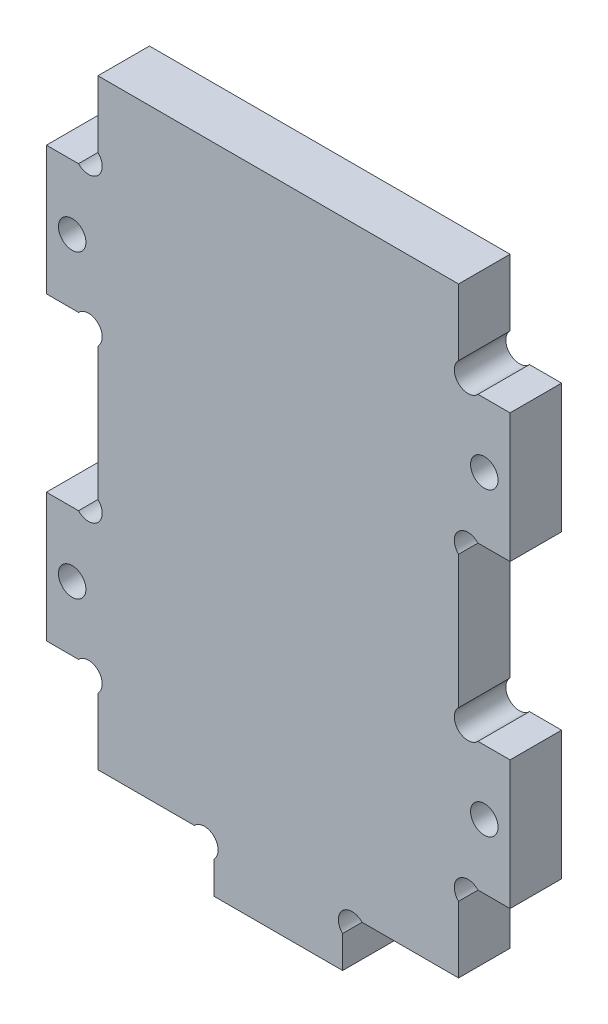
ISO-10303-21;
HEADER;
FILE_DESCRIPTION(('STEP AP214'),'2;1');
FILE_NAME('part.step','',(''),(''),'','','');
FILE_SCHEMA(('AUTOMOTIVE_DESIGN { 1 0 10303 214 1 1 1 1 }'));
ENDSEC;
DATA;
#1=APPLICATION_CONTEXT('core data for automotive mechanical design processes');
#2=APPLICATION_PROTOCOL_DEFINITION('international standard','automotive_design',2000,#1);
#3=PRODUCT_CONTEXT('',#1,'mechanical');
#4=PRODUCT('Part','Part','',(#3));
#5=PRODUCT_RELATED_PRODUCT_CATEGORY('part','',(#4));
#6=PRODUCT_DEFINITION_FORMATION('','',#4);
#7=PRODUCT_DEFINITION_CONTEXT('part definition',#1,'design');
#8=PRODUCT_DEFINITION('design','',#6,#7);
#9=PRODUCT_DEFINITION_SHAPE('','',#8);
#10=(LENGTH_UNIT() NAMED_UNIT(*) SI_UNIT(.MILLI.,.METRE.));
#11=(NAMED_UNIT(*) PLANE_ANGLE_UNIT() SI_UNIT($,.RADIAN.));
#12=(NAMED_UNIT(*) SI_UNIT($,.STERADIAN.) SOLID_ANGLE_UNIT());
#13=UNCERTAINTY_MEASURE_WITH_UNIT(LENGTH_MEASURE(1.E-05),#10,'distance_accuracy_value','');
#14=(GEOMETRIC_REPRESENTATION_CONTEXT(3) GLOBAL_UNCERTAINTY_ASSIGNED_CONTEXT((#13)) GLOBAL_UNIT_ASSIGNED_CONTEXT((#10,
#11,#12)) REPRESENTATION_CONTEXT('',''));
#15=CARTESIAN_POINT('',(0.,0.,0.));
#16=DIRECTION('',(0.,0.,1.));
#17=DIRECTION('',(1.,0.,0.));
#18=AXIS2_PLACEMENT_3D('',#15,#16,#17);
#19=CARTESIAN_POINT('',(22.1,61.1,6.));
#20=DIRECTION('',(0.,0.,1.));
#21=DIRECTION('',(1.,0.,0.));
#22=AXIS2_PLACEMENT_3D('',#19,#20,#21);
#23=PLANE('',#22);
#24=CARTESIAN_POINT('',(-24.,52.5,6.));
#25=DIRECTION('',(0.,0.,1.));
#26=DIRECTION('',(-1.,0.,0.));
#27=AXIS2_PLACEMENT_3D('',#24,#25,#26);
#28=CIRCLE('',#27,1.6);
#29=CARTESIAN_POINT('',(-25.6,52.5,6.));
#30=VERTEX_POINT('',#29);
#31=EDGE_CURVE('E705',#30,#30,#28,.T.);
#32=ORIENTED_EDGE('',*,*,#31,.F.);
#33=EDGE_LOOP('',(#32));
#34=FACE_BOUND('',#33,.T.);
#35=CARTESIAN_POINT('',(24.,52.5,6.));
#36=DIRECTION('',(0.,0.,1.));
#37=DIRECTION('',(1.,0.,0.));
#38=AXIS2_PLACEMENT_3D('',#35,#36,#37);
#39=CIRCLE('',#38,1.6);
#40=CARTESIAN_POINT('',(25.6,52.5,6.));
#41=VERTEX_POINT('',#40);
#42=EDGE_CURVE('E275',#41,#41,#39,.T.);
#43=ORIENTED_EDGE('',*,*,#42,.F.);
#44=EDGE_LOOP('',(#43));
#45=FACE_BOUND('',#44,.T.);
#46=DIRECTION('',(0.,1.,0.));
#47=VECTOR('',#46,1.);
#48=CARTESIAN_POINT('',(21.,70.,6.));
#49=LINE('',#48,#47);
#50=CARTESIAN_POINT('',(21.,62.2618950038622,6.));
#51=VERTEX_POINT('',#50);
#52=CARTESIAN_POINT('',(21.,70.,6.));
#53=VERTEX_POINT('',#52);
#54=EDGE_CURVE('E345',#51,#53,#49,.T.);
#55=ORIENTED_EDGE('',*,*,#54,.T.);
#56=DIRECTION('',(-1.,0.,0.));
#57=VECTOR('',#56,1.);
#58=CARTESIAN_POINT('',(-21.,70.,6.));
#59=LINE('',#58,#57);
#60=CARTESIAN_POINT('',(-21.,70.,6.));
#61=VERTEX_POINT('',#60);
#62=EDGE_CURVE('E270',#53,#61,#59,.T.);
#63=ORIENTED_EDGE('',*,*,#62,.T.);
#64=DIRECTION('',(0.,-1.,0.));
#65=VECTOR('',#64,1.);
#66=CARTESIAN_POINT('',(-21.,70.,6.));
#67=LINE('',#66,#65);
#68=CARTESIAN_POINT('',(-21.,62.2618950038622,6.));
#69=VERTEX_POINT('',#68);
#70=EDGE_CURVE('E348',#61,#69,#67,.T.);
#71=ORIENTED_EDGE('',*,*,#70,.T.);
#72=CARTESIAN_POINT('',(-22.1,61.1,6.));
#73=DIRECTION('',(0.,0.,-1.));
#74=DIRECTION('',(-1.,0.,0.));
#75=AXIS2_PLACEMENT_3D('',#72,#73,#74);
#76=CIRCLE('',#75,1.6);
#77=CARTESIAN_POINT('',(-23.2618950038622,60.,6.));
#78=VERTEX_POINT('',#77);
#79=EDGE_CURVE('E350',#69,#78,#76,.T.);
#80=ORIENTED_EDGE('',*,*,#79,.T.);
#81=DIRECTION('',(-1.,0.,0.));
#82=VECTOR('',#81,1.);
#83=CARTESIAN_POINT('',(-23.2618950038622,60.,6.));
#84=LINE('',#83,#82);
#85=CARTESIAN_POINT('',(-27.,60.,6.));
#86=VERTEX_POINT('',#85);
#87=EDGE_CURVE('E352',#78,#86,#84,.T.);
#88=ORIENTED_EDGE('',*,*,#87,.T.);
#89=DIRECTION('',(0.,-1.,0.));
#90=VECTOR('',#89,1.);
#91=CARTESIAN_POINT('',(-27.,60.,6.));
#92=LINE('',#91,#90);
#93=CARTESIAN_POINT('',(-27.,45.,6.));
#94=VERTEX_POINT('',#93);
#95=EDGE_CURVE('E354',#86,#94,#92,.T.);
#96=ORIENTED_EDGE('',*,*,#95,.T.);
#97=DIRECTION('',(1.,0.,0.));
#98=VECTOR('',#97,1.);
#99=CARTESIAN_POINT('',(-27.,45.,6.));
#100=LINE('',#99,#98);
#101=CARTESIAN_POINT('',(-23.2618950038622,45.,6.));
#102=VERTEX_POINT('',#101);
#103=EDGE_CURVE('E356',#94,#102,#100,.T.);
#104=ORIENTED_EDGE('',*,*,#103,.T.);
#105=CARTESIAN_POINT('',(-22.1,43.9,6.));
#106=DIRECTION('',(0.,0.,-1.));
#107=DIRECTION('',(-1.,0.,0.));
#108=AXIS2_PLACEMENT_3D('',#105,#106,#107);
#109=CIRCLE('',#108,1.6);
#110=CARTESIAN_POINT('',(-21.,42.7381049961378,6.));
#111=VERTEX_POINT('',#110);
#112=EDGE_CURVE('E358',#102,#111,#109,.T.);
#113=ORIENTED_EDGE('',*,*,#112,.T.);
#114=DIRECTION('',(0.,-1.,0.));
#115=VECTOR('',#114,1.);
#116=CARTESIAN_POINT('',(-21.,42.7381049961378,6.));
#117=LINE('',#116,#115);
#118=CARTESIAN_POINT('',(-21.,27.2618950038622,6.));
#119=VERTEX_POINT('',#118);
#120=EDGE_CURVE('E360',#111,#119,#117,.T.);
#121=ORIENTED_EDGE('',*,*,#120,.T.);
#122=CARTESIAN_POINT('',(-22.1,26.1,6.));
#123=DIRECTION('',(0.,0.,-1.));
#124=DIRECTION('',(-1.,0.,0.));
#125=AXIS2_PLACEMENT_3D('',#122,#123,#124);
#126=CIRCLE('',#125,1.6);
#127=CARTESIAN_POINT('',(-23.2618950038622,25.,6.));
#128=VERTEX_POINT('',#127);
#129=EDGE_CURVE('E362',#119,#128,#126,.T.);
#130=ORIENTED_EDGE('',*,*,#129,.T.);
#131=DIRECTION('',(-1.,0.,0.));
#132=VECTOR('',#131,1.);
#133=CARTESIAN_POINT('',(-23.2618950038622,25.,6.));
#134=LINE('',#133,#132);
#135=CARTESIAN_POINT('',(-27.,25.,6.));
#136=VERTEX_POINT('',#135);
#137=EDGE_CURVE('E364',#128,#136,#134,.T.);
#138=ORIENTED_EDGE('',*,*,#137,.T.);
#139=DIRECTION('',(0.,-1.,0.));
#140=VECTOR('',#139,1.);
#141=CARTESIAN_POINT('',(-27.,25.,6.));
#142=LINE('',#141,#140);
#143=CARTESIAN_POINT('',(-27.,10.,6.));
#144=VERTEX_POINT('',#143);
#145=EDGE_CURVE('E366',#136,#144,#142,.T.);
#146=ORIENTED_EDGE('',*,*,#145,.T.);
#147=DIRECTION('',(1.,0.,0.));
#148=VECTOR('',#147,1.);
#149=CARTESIAN_POINT('',(-27.,10.,6.));
#150=LINE('',#149,#148);
#151=CARTESIAN_POINT('',(-23.2618950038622,10.,6.));
#152=VERTEX_POINT('',#151);
#153=EDGE_CURVE('E368',#144,#152,#150,.T.);
#154=ORIENTED_EDGE('',*,*,#153,.T.);
#155=CARTESIAN_POINT('',(-22.1,8.9,6.));
#156=DIRECTION('',(0.,0.,-1.));
#157=DIRECTION('',(-1.,0.,0.));
#158=AXIS2_PLACEMENT_3D('',#155,#156,#157);
#159=CIRCLE('',#158,1.6);
#160=CARTESIAN_POINT('',(-21.,7.73810499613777,6.));
#161=VERTEX_POINT('',#160);
#162=EDGE_CURVE('E370',#152,#161,#159,.T.);
#163=ORIENTED_EDGE('',*,*,#162,.T.);
#164=DIRECTION('',(0.,-1.,0.));
#165=VECTOR('',#164,1.);
#166=CARTESIAN_POINT('',(-21.,7.73810499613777,6.));
#167=LINE('',#166,#165);
#168=CARTESIAN_POINT('',(-21.,0.,6.));
#169=VERTEX_POINT('',#168);
#170=EDGE_CURVE('E372',#161,#169,#167,.T.);
#171=ORIENTED_EDGE('',*,*,#170,.T.);
#172=DIRECTION('',(1.,0.,0.));
#173=VECTOR('',#172,1.);
#174=CARTESIAN_POINT('',(-9.76189500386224,0.,6.));
#175=LINE('',#174,#173);
#176=CARTESIAN_POINT('',(-9.76189500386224,0.,6.));
#177=VERTEX_POINT('',#176);
#178=EDGE_CURVE('E374',#169,#177,#175,.T.);
#179=ORIENTED_EDGE('',*,*,#178,.T.);
#180=CARTESIAN_POINT('',(-8.60000000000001,-1.1,6.));
#181=DIRECTION('',(0.,0.,-1.));
#182=DIRECTION('',(-1.,0.,0.));
#183=AXIS2_PLACEMENT_3D('',#180,#181,#182);
#184=CIRCLE('',#183,1.6);
#185=CARTESIAN_POINT('',(-7.50000000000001,-2.26189500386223,6.));
#186=VERTEX_POINT('',#185);
#187=EDGE_CURVE('E376',#177,#186,#184,.T.);
#188=ORIENTED_EDGE('',*,*,#187,.T.);
#189=DIRECTION('',(0.,-1.,0.));
#190=VECTOR('',#189,1.);
#191=CARTESIAN_POINT('',(-7.50000000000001,-2.26189500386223,6.));
#192=LINE('',#191,#190);
#193=CARTESIAN_POINT('',(-7.50000000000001,-6.,6.));
#194=VERTEX_POINT('',#193);
#195=EDGE_CURVE('E378',#186,#194,#192,.T.);
#196=ORIENTED_EDGE('',*,*,#195,.T.);
#197=DIRECTION('',(1.,0.,0.));
#198=VECTOR('',#197,1.);
#199=CARTESIAN_POINT('',(7.50000000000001,-6.,6.));
#200=LINE('',#199,#198);
#201=CARTESIAN_POINT('',(7.50000000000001,-6.,6.));
#202=VERTEX_POINT('',#201);
#203=EDGE_CURVE('E380',#194,#202,#200,.T.);
#204=ORIENTED_EDGE('',*,*,#203,.T.);
#205=DIRECTION('',(0.,1.,0.));
#206=VECTOR('',#205,1.);
#207=CARTESIAN_POINT('',(7.50000000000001,-2.26189500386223,6.));
#208=LINE('',#207,#206);
#209=CARTESIAN_POINT('',(7.50000000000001,-2.26189500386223,6.));
#210=VERTEX_POINT('',#209);
#211=EDGE_CURVE('E382',#202,#210,#208,.T.);
#212=ORIENTED_EDGE('',*,*,#211,.T.);
#213=CARTESIAN_POINT('',(8.60000000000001,-1.1,6.));
#214=DIRECTION('',(0.,0.,-1.));
#215=DIRECTION('',(1.,0.,0.));
#216=AXIS2_PLACEMENT_3D('',#213,#214,#215);
#217=CIRCLE('',#216,1.6);
#218=CARTESIAN_POINT('',(9.76189500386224,0.,6.));
#219=VERTEX_POINT('',#218);
#220=EDGE_CURVE('E384',#210,#219,#217,.T.);
#221=ORIENTED_EDGE('',*,*,#220,.T.);
#222=DIRECTION('',(1.,0.,0.));
#223=VECTOR('',#222,1.);
#224=CARTESIAN_POINT('',(9.76189500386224,0.,6.));
#225=LINE('',#224,#223);
#226=CARTESIAN_POINT('',(21.,0.,6.));
#227=VERTEX_POINT('',#226);
#228=EDGE_CURVE('E386',#219,#227,#225,.T.);
#229=ORIENTED_EDGE('',*,*,#228,.T.);
#230=DIRECTION('',(0.,1.,0.));
#231=VECTOR('',#230,1.);
#232=CARTESIAN_POINT('',(21.,7.73810499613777,6.));
#233=LINE('',#232,#231);
#234=CARTESIAN_POINT('',(21.,7.73810499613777,6.));
#235=VERTEX_POINT('',#234);
#236=EDGE_CURVE('E388',#227,#235,#233,.T.);
#237=ORIENTED_EDGE('',*,*,#236,.T.);
#238=CARTESIAN_POINT('',(22.1,8.9,6.));
#239=DIRECTION('',(0.,0.,-1.));
#240=DIRECTION('',(1.,0.,0.));
#241=AXIS2_PLACEMENT_3D('',#238,#239,#240);
#242=CIRCLE('',#241,1.6);
#243=CARTESIAN_POINT('',(23.2618950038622,10.,6.));
#244=VERTEX_POINT('',#243);
#245=EDGE_CURVE('E390',#235,#244,#242,.T.);
#246=ORIENTED_EDGE('',*,*,#245,.T.);
#247=DIRECTION('',(1.,0.,0.));
#248=VECTOR('',#247,1.);
#249=CARTESIAN_POINT('',(27.,10.,6.));
#250=LINE('',#249,#248);
#251=CARTESIAN_POINT('',(27.,10.,6.));
#252=VERTEX_POINT('',#251);
#253=EDGE_CURVE('E392',#244,#252,#250,.T.);
#254=ORIENTED_EDGE('',*,*,#253,.T.);
#255=DIRECTION('',(0.,1.,0.));
#256=VECTOR('',#255,1.);
#257=CARTESIAN_POINT('',(27.,25.,6.));
#258=LINE('',#257,#256);
#259=CARTESIAN_POINT('',(27.,25.,6.));
#260=VERTEX_POINT('',#259);
#261=EDGE_CURVE('E394',#252,#260,#258,.T.);
#262=ORIENTED_EDGE('',*,*,#261,.T.);
#263=DIRECTION('',(-1.,0.,0.));
#264=VECTOR('',#263,1.);
#265=CARTESIAN_POINT('',(23.2618950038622,25.,6.));
#266=LINE('',#265,#264);
#267=CARTESIAN_POINT('',(23.2618950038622,25.,6.));
#268=VERTEX_POINT('',#267);
#269=EDGE_CURVE('E396',#260,#268,#266,.T.);
#270=ORIENTED_EDGE('',*,*,#269,.T.);
#271=CARTESIAN_POINT('',(22.1,26.1,6.));
#272=DIRECTION('',(0.,0.,-1.));
#273=DIRECTION('',(1.,0.,0.));
#274=AXIS2_PLACEMENT_3D('',#271,#272,#273);
#275=CIRCLE('',#274,1.6);
#276=CARTESIAN_POINT('',(21.,27.2618950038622,6.));
#277=VERTEX_POINT('',#276);
#278=EDGE_CURVE('E398',#268,#277,#275,.T.);
#279=ORIENTED_EDGE('',*,*,#278,.T.);
#280=DIRECTION('',(0.,1.,0.));
#281=VECTOR('',#280,1.);
#282=CARTESIAN_POINT('',(21.,42.7381049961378,6.));
#283=LINE('',#282,#281);
#284=CARTESIAN_POINT('',(21.,42.7381049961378,6.));
#285=VERTEX_POINT('',#284);
#286=EDGE_CURVE('E400',#277,#285,#283,.T.);
#287=ORIENTED_EDGE('',*,*,#286,.T.);
#288=CARTESIAN_POINT('',(22.1,43.9,6.));
#289=DIRECTION('',(0.,0.,-1.));
#290=DIRECTION('',(1.,0.,0.));
#291=AXIS2_PLACEMENT_3D('',#288,#289,#290);
#292=CIRCLE('',#291,1.6);
#293=CARTESIAN_POINT('',(23.2618950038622,45.,6.));
#294=VERTEX_POINT('',#293);
#295=EDGE_CURVE('E402',#285,#294,#292,.T.);
#296=ORIENTED_EDGE('',*,*,#295,.T.);
#297=DIRECTION('',(1.,0.,0.));
#298=VECTOR('',#297,1.);
#299=CARTESIAN_POINT('',(27.,45.,6.));
#300=LINE('',#299,#298);
#301=CARTESIAN_POINT('',(27.,45.,6.));
#302=VERTEX_POINT('',#301);
#303=EDGE_CURVE('E404',#294,#302,#300,.T.);
#304=ORIENTED_EDGE('',*,*,#303,.T.);
#305=DIRECTION('',(0.,1.,0.));
#306=VECTOR('',#305,1.);
#307=CARTESIAN_POINT('',(27.,60.,6.));
#308=LINE('',#307,#306);
#309=CARTESIAN_POINT('',(27.,60.,6.));
#310=VERTEX_POINT('',#309);
#311=EDGE_CURVE('E406',#302,#310,#308,.T.);
#312=ORIENTED_EDGE('',*,*,#311,.T.);
#313=DIRECTION('',(-1.,0.,0.));
#314=VECTOR('',#313,1.);
#315=CARTESIAN_POINT('',(23.2618950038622,60.,6.));
#316=LINE('',#315,#314);
#317=CARTESIAN_POINT('',(23.2618950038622,60.,6.));
#318=VERTEX_POINT('',#317);
#319=EDGE_CURVE('E55',#310,#318,#316,.T.);
#320=ORIENTED_EDGE('',*,*,#319,.T.);
#321=CARTESIAN_POINT('',(22.1,61.1,6.));
#322=DIRECTION('',(0.,0.,-1.));
#323=DIRECTION('',(1.,0.,0.));
#324=AXIS2_PLACEMENT_3D('',#321,#322,#323);
#325=CIRCLE('',#324,1.6);
#326=EDGE_CURVE('E50',#318,#51,#325,.T.);
#327=ORIENTED_EDGE('',*,*,#326,.T.);
#328=EDGE_LOOP('',(#55,#63,#71,#80,#88,#96,#104,#113,#121,#130,#138,#146,#154,#163,#171,#179,
#188,#196,#204,#212,#221,#229,#237,#246,#254,#262,#270,#279,#287,#296,#304,#312,#320,#327));
#329=FACE_BOUND('',#328,.T.);
#330=CARTESIAN_POINT('',(24.,17.5,6.));
#331=DIRECTION('',(0.,0.,1.));
#332=DIRECTION('',(1.,0.,0.));
#333=AXIS2_PLACEMENT_3D('',#330,#331,#332);
#334=CIRCLE('',#333,1.6);
#335=CARTESIAN_POINT('',(25.6,17.5,6.));
#336=VERTEX_POINT('',#335);
#337=EDGE_CURVE('E711',#336,#336,#334,.T.);
#338=ORIENTED_EDGE('',*,*,#337,.F.);
#339=EDGE_LOOP('',(#338));
#340=FACE_BOUND('',#339,.T.);
#341=CARTESIAN_POINT('',(-24.,17.5,6.));
#342=DIRECTION('',(0.,0.,1.));
#343=DIRECTION('',(-1.,0.,0.));
#344=AXIS2_PLACEMENT_3D('',#341,#342,#343);
#345=CIRCLE('',#344,1.6);
#346=CARTESIAN_POINT('',(-25.6,17.5,6.));
#347=VERTEX_POINT('',#346);
#348=EDGE_CURVE('E694',#347,#347,#345,.T.);
#349=ORIENTED_EDGE('',*,*,#348,.F.);
#350=EDGE_LOOP('',(#349));
#351=FACE_BOUND('',#350,.T.);
#352=ADVANCED_FACE('F35',(#34,#45,#329,#340,#351),#23,.T.);
#353=CARTESIAN_POINT('',(22.1,61.1,0.));
#354=DIRECTION('',(0.,0.,1.));
#355=DIRECTION('',(1.,0.,0.));
#356=AXIS2_PLACEMENT_3D('',#353,#354,#355);
#357=PLANE('',#356);
#358=CARTESIAN_POINT('',(-24.,52.5,0.));
#359=DIRECTION('',(0.,0.,1.));
#360=DIRECTION('',(-1.,0.,0.));
#361=AXIS2_PLACEMENT_3D('',#358,#359,#360);
#362=CIRCLE('',#361,1.6);
#363=CARTESIAN_POINT('',(-25.6,52.5,0.));
#364=VERTEX_POINT('',#363);
#365=EDGE_CURVE('E700',#364,#364,#362,.T.);
#366=ORIENTED_EDGE('',*,*,#365,.T.);
#367=EDGE_LOOP('',(#366));
#368=FACE_BOUND('',#367,.T.);
#369=CARTESIAN_POINT('',(24.,52.5,0.));
#370=DIRECTION('',(0.,0.,1.));
#371=DIRECTION('',(1.,0.,0.));
#372=AXIS2_PLACEMENT_3D('',#369,#370,#371);
#373=CIRCLE('',#372,1.6);
#374=CARTESIAN_POINT('',(25.6,52.5,0.));
#375=VERTEX_POINT('',#374);
#376=EDGE_CURVE('E278',#375,#375,#373,.T.);
#377=ORIENTED_EDGE('',*,*,#376,.T.);
#378=EDGE_LOOP('',(#377));
#379=FACE_BOUND('',#378,.T.);
#380=DIRECTION('',(0.,1.,0.));
#381=VECTOR('',#380,1.);
#382=CARTESIAN_POINT('',(21.,70.,0.));
#383=LINE('',#382,#381);
#384=CARTESIAN_POINT('',(21.,62.2618950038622,0.));
#385=VERTEX_POINT('',#384);
#386=CARTESIAN_POINT('',(21.,70.,0.));
#387=VERTEX_POINT('',#386);
#388=EDGE_CURVE('E261',#385,#387,#383,.T.);
#389=ORIENTED_EDGE('',*,*,#388,.F.);
#390=CARTESIAN_POINT('',(22.1,61.1,0.));
#391=DIRECTION('',(0.,0.,-1.));
#392=DIRECTION('',(1.,0.,0.));
#393=AXIS2_PLACEMENT_3D('',#390,#391,#392);
#394=CIRCLE('',#393,1.6);
#395=CARTESIAN_POINT('',(23.2618950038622,60.,0.));
#396=VERTEX_POINT('',#395);
#397=EDGE_CURVE('E343',#396,#385,#394,.T.);
#398=ORIENTED_EDGE('',*,*,#397,.F.);
#399=DIRECTION('',(-1.,0.,0.));
#400=VECTOR('',#399,1.);
#401=CARTESIAN_POINT('',(23.2618950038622,60.,0.));
#402=LINE('',#401,#400);
#403=CARTESIAN_POINT('',(27.,60.,0.));
#404=VERTEX_POINT('',#403);
#405=EDGE_CURVE('E341',#404,#396,#402,.T.);
#406=ORIENTED_EDGE('',*,*,#405,.F.);
#407=DIRECTION('',(0.,1.,0.));
#408=VECTOR('',#407,1.);
#409=CARTESIAN_POINT('',(27.,60.,0.));
#410=LINE('',#409,#408);
#411=CARTESIAN_POINT('',(27.,45.,0.));
#412=VERTEX_POINT('',#411);
#413=EDGE_CURVE('E339',#412,#404,#410,.T.);
#414=ORIENTED_EDGE('',*,*,#413,.F.);
#415=DIRECTION('',(1.,0.,0.));
#416=VECTOR('',#415,1.);
#417=CARTESIAN_POINT('',(27.,45.,0.));
#418=LINE('',#417,#416);
#419=CARTESIAN_POINT('',(23.2618950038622,45.,0.));
#420=VERTEX_POINT('',#419);
#421=EDGE_CURVE('E337',#420,#412,#418,.T.);
#422=ORIENTED_EDGE('',*,*,#421,.F.);
#423=CARTESIAN_POINT('',(22.1,43.9,0.));
#424=DIRECTION('',(0.,0.,-1.));
#425=DIRECTION('',(1.,0.,0.));
#426=AXIS2_PLACEMENT_3D('',#423,#424,#425);
#427=CIRCLE('',#426,1.6);
#428=CARTESIAN_POINT('',(21.,42.7381049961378,0.));
#429=VERTEX_POINT('',#428);
#430=EDGE_CURVE('E335',#429,#420,#427,.T.);
#431=ORIENTED_EDGE('',*,*,#430,.F.);
#432=DIRECTION('',(0.,1.,0.));
#433=VECTOR('',#432,1.);
#434=CARTESIAN_POINT('',(21.,42.7381049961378,0.));
#435=LINE('',#434,#433);
#436=CARTESIAN_POINT('',(21.,27.2618950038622,0.));
#437=VERTEX_POINT('',#436);
#438=EDGE_CURVE('E333',#437,#429,#435,.T.);
#439=ORIENTED_EDGE('',*,*,#438,.F.);
#440=CARTESIAN_POINT('',(22.1,26.1,0.));
#441=DIRECTION('',(0.,0.,-1.));
#442=DIRECTION('',(1.,0.,0.));
#443=AXIS2_PLACEMENT_3D('',#440,#441,#442);
#444=CIRCLE('',#443,1.6);
#445=CARTESIAN_POINT('',(23.2618950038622,25.,0.));
#446=VERTEX_POINT('',#445);
#447=EDGE_CURVE('E331',#446,#437,#444,.T.);
#448=ORIENTED_EDGE('',*,*,#447,.F.);
#449=DIRECTION('',(-1.,0.,0.));
#450=VECTOR('',#449,1.);
#451=CARTESIAN_POINT('',(23.2618950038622,25.,0.));
#452=LINE('',#451,#450);
#453=CARTESIAN_POINT('',(27.,25.,0.));
#454=VERTEX_POINT('',#453);
#455=EDGE_CURVE('E329',#454,#446,#452,.T.);
#456=ORIENTED_EDGE('',*,*,#455,.F.);
#457=DIRECTION('',(0.,1.,0.));
#458=VECTOR('',#457,1.);
#459=CARTESIAN_POINT('',(27.,25.,0.));
#460=LINE('',#459,#458);
#461=CARTESIAN_POINT('',(27.,10.,0.));
#462=VERTEX_POINT('',#461);
#463=EDGE_CURVE('E327',#462,#454,#460,.T.);
#464=ORIENTED_EDGE('',*,*,#463,.F.);
#465=DIRECTION('',(1.,0.,0.));
#466=VECTOR('',#465,1.);
#467=CARTESIAN_POINT('',(27.,10.,0.));
#468=LINE('',#467,#466);
#469=CARTESIAN_POINT('',(23.2618950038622,10.,0.));
#470=VERTEX_POINT('',#469);
#471=EDGE_CURVE('E325',#470,#462,#468,.T.);
#472=ORIENTED_EDGE('',*,*,#471,.F.);
#473=CARTESIAN_POINT('',(22.1,8.9,0.));
#474=DIRECTION('',(0.,0.,-1.));
#475=DIRECTION('',(1.,0.,0.));
#476=AXIS2_PLACEMENT_3D('',#473,#474,#475);
#477=CIRCLE('',#476,1.6);
#478=CARTESIAN_POINT('',(21.,7.73810499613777,0.));
#479=VERTEX_POINT('',#478);
#480=EDGE_CURVE('E323',#479,#470,#477,.T.);
#481=ORIENTED_EDGE('',*,*,#480,.F.);
#482=DIRECTION('',(0.,1.,0.));
#483=VECTOR('',#482,1.);
#484=CARTESIAN_POINT('',(21.,7.73810499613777,0.));
#485=LINE('',#484,#483);
#486=CARTESIAN_POINT('',(21.,0.,0.));
#487=VERTEX_POINT('',#486);
#488=EDGE_CURVE('E321',#487,#479,#485,.T.);
#489=ORIENTED_EDGE('',*,*,#488,.F.);
#490=DIRECTION('',(1.,0.,0.));
#491=VECTOR('',#490,1.);
#492=CARTESIAN_POINT('',(9.76189500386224,0.,0.));
#493=LINE('',#492,#491);
#494=CARTESIAN_POINT('',(9.76189500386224,0.,0.));
#495=VERTEX_POINT('',#494);
#496=EDGE_CURVE('E319',#495,#487,#493,.T.);
#497=ORIENTED_EDGE('',*,*,#496,.F.);
#498=CARTESIAN_POINT('',(8.60000000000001,-1.1,0.));
#499=DIRECTION('',(0.,0.,-1.));
#500=DIRECTION('',(1.,0.,0.));
#501=AXIS2_PLACEMENT_3D('',#498,#499,#500);
#502=CIRCLE('',#501,1.6);
#503=CARTESIAN_POINT('',(7.50000000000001,-2.26189500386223,0.));
#504=VERTEX_POINT('',#503);
#505=EDGE_CURVE('E317',#504,#495,#502,.T.);
#506=ORIENTED_EDGE('',*,*,#505,.F.);
#507=DIRECTION('',(0.,1.,0.));
#508=VECTOR('',#507,1.);
#509=CARTESIAN_POINT('',(7.50000000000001,-2.26189500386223,0.));
#510=LINE('',#509,#508);
#511=CARTESIAN_POINT('',(7.50000000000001,-6.,0.));
#512=VERTEX_POINT('',#511);
#513=EDGE_CURVE('E315',#512,#504,#510,.T.);
#514=ORIENTED_EDGE('',*,*,#513,.F.);
#515=DIRECTION('',(1.,0.,0.));
#516=VECTOR('',#515,1.);
#517=CARTESIAN_POINT('',(7.50000000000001,-6.,0.));
#518=LINE('',#517,#516);
#519=CARTESIAN_POINT('',(-7.50000000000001,-6.,0.));
#520=VERTEX_POINT('',#519);
#521=EDGE_CURVE('E313',#520,#512,#518,.T.);
#522=ORIENTED_EDGE('',*,*,#521,.F.);
#523=DIRECTION('',(0.,-1.,0.));
#524=VECTOR('',#523,1.);
#525=CARTESIAN_POINT('',(-7.50000000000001,-2.26189500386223,0.));
#526=LINE('',#525,#524);
#527=CARTESIAN_POINT('',(-7.50000000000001,-2.26189500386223,0.));
#528=VERTEX_POINT('',#527);
#529=EDGE_CURVE('E311',#528,#520,#526,.T.);
#530=ORIENTED_EDGE('',*,*,#529,.F.);
#531=CARTESIAN_POINT('',(-8.60000000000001,-1.1,0.));
#532=DIRECTION('',(0.,0.,-1.));
#533=DIRECTION('',(-1.,0.,0.));
#534=AXIS2_PLACEMENT_3D('',#531,#532,#533);
#535=CIRCLE('',#534,1.6);
#536=CARTESIAN_POINT('',(-9.76189500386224,0.,0.));
#537=VERTEX_POINT('',#536);
#538=EDGE_CURVE('E309',#537,#528,#535,.T.);
#539=ORIENTED_EDGE('',*,*,#538,.F.);
#540=DIRECTION('',(1.,0.,0.));
#541=VECTOR('',#540,1.);
#542=CARTESIAN_POINT('',(-9.76189500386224,0.,0.));
#543=LINE('',#542,#541);
#544=CARTESIAN_POINT('',(-21.,0.,0.));
#545=VERTEX_POINT('',#544);
#546=EDGE_CURVE('E307',#545,#537,#543,.T.);
#547=ORIENTED_EDGE('',*,*,#546,.F.);
#548=DIRECTION('',(0.,-1.,0.));
#549=VECTOR('',#548,1.);
#550=CARTESIAN_POINT('',(-21.,7.73810499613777,0.));
#551=LINE('',#550,#549);
#552=CARTESIAN_POINT('',(-21.,7.73810499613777,0.));
#553=VERTEX_POINT('',#552);
#554=EDGE_CURVE('E305',#553,#545,#551,.T.);
#555=ORIENTED_EDGE('',*,*,#554,.F.);
#556=CARTESIAN_POINT('',(-22.1,8.9,0.));
#557=DIRECTION('',(0.,0.,-1.));
#558=DIRECTION('',(-1.,0.,0.));
#559=AXIS2_PLACEMENT_3D('',#556,#557,#558);
#560=CIRCLE('',#559,1.6);
#561=CARTESIAN_POINT('',(-23.2618950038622,10.,0.));
#562=VERTEX_POINT('',#561);
#563=EDGE_CURVE('E303',#562,#553,#560,.T.);
#564=ORIENTED_EDGE('',*,*,#563,.F.);
#565=DIRECTION('',(1.,0.,0.));
#566=VECTOR('',#565,1.);
#567=CARTESIAN_POINT('',(-27.,10.,0.));
#568=LINE('',#567,#566);
#569=CARTESIAN_POINT('',(-27.,10.,0.));
#570=VERTEX_POINT('',#569);
#571=EDGE_CURVE('E301',#570,#562,#568,.T.);
#572=ORIENTED_EDGE('',*,*,#571,.F.);
#573=DIRECTION('',(0.,-1.,0.));
#574=VECTOR('',#573,1.);
#575=CARTESIAN_POINT('',(-27.,25.,0.));
#576=LINE('',#575,#574);
#577=CARTESIAN_POINT('',(-27.,25.,0.));
#578=VERTEX_POINT('',#577);
#579=EDGE_CURVE('E299',#578,#570,#576,.T.);
#580=ORIENTED_EDGE('',*,*,#579,.F.);
#581=DIRECTION('',(-1.,0.,0.));
#582=VECTOR('',#581,1.);
#583=CARTESIAN_POINT('',(-23.2618950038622,25.,0.));
#584=LINE('',#583,#582);
#585=CARTESIAN_POINT('',(-23.2618950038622,25.,0.));
#586=VERTEX_POINT('',#585);
#587=EDGE_CURVE('E297',#586,#578,#584,.T.);
#588=ORIENTED_EDGE('',*,*,#587,.F.);
#589=CARTESIAN_POINT('',(-22.1,26.1,0.));
#590=DIRECTION('',(0.,0.,-1.));
#591=DIRECTION('',(-1.,0.,0.));
#592=AXIS2_PLACEMENT_3D('',#589,#590,#591);
#593=CIRCLE('',#592,1.6);
#594=CARTESIAN_POINT('',(-21.,27.2618950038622,0.));
#595=VERTEX_POINT('',#594);
#596=EDGE_CURVE('E295',#595,#586,#593,.T.);
#597=ORIENTED_EDGE('',*,*,#596,.F.);
#598=DIRECTION('',(0.,-1.,0.));
#599=VECTOR('',#598,1.);
#600=CARTESIAN_POINT('',(-21.,42.7381049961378,0.));
#601=LINE('',#600,#599);
#602=CARTESIAN_POINT('',(-21.,42.7381049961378,0.));
#603=VERTEX_POINT('',#602);
#604=EDGE_CURVE('E293',#603,#595,#601,.T.);
#605=ORIENTED_EDGE('',*,*,#604,.F.);
#606=CARTESIAN_POINT('',(-22.1,43.9,0.));
#607=DIRECTION('',(0.,0.,-1.));
#608=DIRECTION('',(-1.,0.,0.));
#609=AXIS2_PLACEMENT_3D('',#606,#607,#608);
#610=CIRCLE('',#609,1.6);
#611=CARTESIAN_POINT('',(-23.2618950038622,45.,0.));
#612=VERTEX_POINT('',#611);
#613=EDGE_CURVE('E291',#612,#603,#610,.T.);
#614=ORIENTED_EDGE('',*,*,#613,.F.);
#615=DIRECTION('',(1.,0.,0.));
#616=VECTOR('',#615,1.);
#617=CARTESIAN_POINT('',(-27.,45.,0.));
#618=LINE('',#617,#616);
#619=CARTESIAN_POINT('',(-27.,45.,0.));
#620=VERTEX_POINT('',#619);
#621=EDGE_CURVE('E289',#620,#612,#618,.T.);
#622=ORIENTED_EDGE('',*,*,#621,.F.);
#623=DIRECTION('',(0.,-1.,0.));
#624=VECTOR('',#623,1.);
#625=CARTESIAN_POINT('',(-27.,60.,0.));
#626=LINE('',#625,#624);
#627=CARTESIAN_POINT('',(-27.,60.,0.));
#628=VERTEX_POINT('',#627);
#629=EDGE_CURVE('E287',#628,#620,#626,.T.);
#630=ORIENTED_EDGE('',*,*,#629,.F.);
#631=DIRECTION('',(-1.,0.,0.));
#632=VECTOR('',#631,1.);
#633=CARTESIAN_POINT('',(-23.2618950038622,60.,0.));
#634=LINE('',#633,#632);
#635=CARTESIAN_POINT('',(-23.2618950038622,60.,0.));
#636=VERTEX_POINT('',#635);
#637=EDGE_CURVE('E285',#636,#628,#634,.T.);
#638=ORIENTED_EDGE('',*,*,#637,.F.);
#639=CARTESIAN_POINT('',(-22.1,61.1,0.));
#640=DIRECTION('',(0.,0.,-1.));
#641=DIRECTION('',(-1.,0.,0.));
#642=AXIS2_PLACEMENT_3D('',#639,#640,#641);
#643=CIRCLE('',#642,1.6);
#644=CARTESIAN_POINT('',(-21.,62.2618950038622,0.));
#645=VERTEX_POINT('',#644);
#646=EDGE_CURVE('E283',#645,#636,#643,.T.);
#647=ORIENTED_EDGE('',*,*,#646,.F.);
#648=DIRECTION('',(0.,-1.,0.));
#649=VECTOR('',#648,1.);
#650=CARTESIAN_POINT('',(-21.,70.,0.));
#651=LINE('',#650,#649);
#652=CARTESIAN_POINT('',(-21.,70.,0.));
#653=VERTEX_POINT('',#652);
#654=EDGE_CURVE('E263',#653,#645,#651,.T.);
#655=ORIENTED_EDGE('',*,*,#654,.F.);
#656=DIRECTION('',(-1.,0.,0.));
#657=VECTOR('',#656,1.);
#658=CARTESIAN_POINT('',(-21.,70.,0.));
#659=LINE('',#658,#657);
#660=EDGE_CURVE('E256',#387,#653,#659,.T.);
#661=ORIENTED_EDGE('',*,*,#660,.F.);
#662=EDGE_LOOP('',(#389,#398,#406,#414,#422,#431,#439,#448,#456,#464,#472,#481,#489,#497,#506,
#514,#522,#530,#539,#547,#555,#564,#572,#580,#588,#597,#605,#614,#622,#630,#638,#647,#655,#661));
#663=FACE_BOUND('',#662,.T.);
#664=CARTESIAN_POINT('',(24.,17.5,0.));
#665=DIRECTION('',(0.,0.,1.));
#666=DIRECTION('',(1.,0.,0.));
#667=AXIS2_PLACEMENT_3D('',#664,#665,#666);
#668=CIRCLE('',#667,1.6);
#669=CARTESIAN_POINT('',(25.6,17.5,0.));
#670=VERTEX_POINT('',#669);
#671=EDGE_CURVE('E708',#670,#670,#668,.T.);
#672=ORIENTED_EDGE('',*,*,#671,.T.);
#673=EDGE_LOOP('',(#672));
#674=FACE_BOUND('',#673,.T.);
#675=CARTESIAN_POINT('',(-24.,17.5,0.));
#676=DIRECTION('',(0.,0.,1.));
#677=DIRECTION('',(-1.,0.,0.));
#678=AXIS2_PLACEMENT_3D('',#675,#676,#677);
#679=CIRCLE('',#678,1.6);
#680=CARTESIAN_POINT('',(-25.6,17.5,0.));
#681=VERTEX_POINT('',#680);
#682=EDGE_CURVE('E697',#681,#681,#679,.T.);
#683=ORIENTED_EDGE('',*,*,#682,.T.);
#684=EDGE_LOOP('',(#683));
#685=FACE_BOUND('',#684,.T.);
#686=ADVANCED_FACE('F257',(#368,#379,#663,#674,#685),#357,.F.);
#687=CARTESIAN_POINT('',(21.,70.,6.));
#688=DIRECTION('',(-1.,0.,0.));
#689=DIRECTION('',(0.,0.,1.));
#690=AXIS2_PLACEMENT_3D('',#687,#688,#689);
#691=PLANE('',#690);
#692=ORIENTED_EDGE('',*,*,#388,.T.);
#693=DIRECTION('',(0.,0.,-1.));
#694=VECTOR('',#693,1.);
#695=CARTESIAN_POINT('',(21.,70.,6.));
#696=LINE('',#695,#694);
#697=EDGE_CURVE('E11',#53,#387,#696,.T.);
#698=ORIENTED_EDGE('',*,*,#697,.F.);
#699=ORIENTED_EDGE('',*,*,#54,.F.);
#700=DIRECTION('',(0.,0.,-1.));
#701=VECTOR('',#700,1.);
#702=CARTESIAN_POINT('',(21.,62.2618950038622,6.));
#703=LINE('',#702,#701);
#704=EDGE_CURVE('E274',#51,#385,#703,.T.);
#705=ORIENTED_EDGE('',*,*,#704,.T.);
#706=EDGE_LOOP('',(#692,#698,#699,#705));
#707=FACE_BOUND('',#706,.T.);
#708=ADVANCED_FACE('F37',(#707),#691,.F.);
#709=CARTESIAN_POINT('',(-21.,70.,6.));
#710=DIRECTION('',(0.,-1.,0.));
#711=DIRECTION('',(0.,0.,-1.));
#712=AXIS2_PLACEMENT_3D('',#709,#710,#711);
#713=PLANE('',#712);
#714=ORIENTED_EDGE('',*,*,#660,.T.);
#715=DIRECTION('',(0.,0.,-1.));
#716=VECTOR('',#715,1.);
#717=CARTESIAN_POINT('',(-21.,70.,6.));
#718=LINE('',#717,#716);
#719=EDGE_CURVE('E43',#61,#653,#718,.T.);
#720=ORIENTED_EDGE('',*,*,#719,.F.);
#721=ORIENTED_EDGE('',*,*,#62,.F.);
#722=ORIENTED_EDGE('',*,*,#697,.T.);
#723=EDGE_LOOP('',(#714,#720,#721,#722));
#724=FACE_BOUND('',#723,.T.);
#725=ADVANCED_FACE('F269',(#724),#713,.F.);
#726=CARTESIAN_POINT('',(-21.,70.,6.));
#727=DIRECTION('',(1.,0.,0.));
#728=DIRECTION('',(0.,0.,-1.));
#729=AXIS2_PLACEMENT_3D('',#726,#727,#728);
#730=PLANE('',#729);
#731=ORIENTED_EDGE('',*,*,#654,.T.);
#732=DIRECTION('',(0.,0.,-1.));
#733=VECTOR('',#732,1.);
#734=CARTESIAN_POINT('',(-21.,62.2618950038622,6.));
#735=LINE('',#734,#733);
#736=EDGE_CURVE('E501',#69,#645,#735,.T.);
#737=ORIENTED_EDGE('',*,*,#736,.F.);
#738=ORIENTED_EDGE('',*,*,#70,.F.);
#739=ORIENTED_EDGE('',*,*,#719,.T.);
#740=EDGE_LOOP('',(#731,#737,#738,#739));
#741=FACE_BOUND('',#740,.T.);
#742=ADVANCED_FACE('F505',(#741),#730,.F.);
#743=CARTESIAN_POINT('',(-22.1,61.1,6.));
#744=DIRECTION('',(0.,0.,-1.));
#745=DIRECTION('',(-1.,0.,0.));
#746=AXIS2_PLACEMENT_3D('',#743,#744,#745);
#747=CYLINDRICAL_SURFACE('',#746,1.6);
#748=ORIENTED_EDGE('',*,*,#646,.T.);
#749=DIRECTION('',(0.,0.,-1.));
#750=VECTOR('',#749,1.);
#751=CARTESIAN_POINT('',(-23.2618950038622,60.,6.));
#752=LINE('',#751,#750);
#753=EDGE_CURVE('E498',#78,#636,#752,.T.);
#754=ORIENTED_EDGE('',*,*,#753,.F.);
#755=ORIENTED_EDGE('',*,*,#79,.F.);
#756=ORIENTED_EDGE('',*,*,#736,.T.);
#757=EDGE_LOOP('',(#748,#754,#755,#756));
#758=FACE_BOUND('',#757,.T.);
#759=ADVANCED_FACE('F513',(#758),#747,.F.);
#760=CARTESIAN_POINT('',(-23.2618950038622,60.,6.));
#761=DIRECTION('',(0.,-1.,0.));
#762=DIRECTION('',(0.,0.,-1.));
#763=AXIS2_PLACEMENT_3D('',#760,#761,#762);
#764=PLANE('',#763);
#765=ORIENTED_EDGE('',*,*,#637,.T.);
#766=DIRECTION('',(0.,0.,-1.));
#767=VECTOR('',#766,1.);
#768=CARTESIAN_POINT('',(-27.,60.,6.));
#769=LINE('',#768,#767);
#770=EDGE_CURVE('E495',#86,#628,#769,.T.);
#771=ORIENTED_EDGE('',*,*,#770,.F.);
#772=ORIENTED_EDGE('',*,*,#87,.F.);
#773=ORIENTED_EDGE('',*,*,#753,.T.);
#774=EDGE_LOOP('',(#765,#771,#772,#773));
#775=FACE_BOUND('',#774,.T.);
#776=ADVANCED_FACE('F516',(#775),#764,.F.);
#777=CARTESIAN_POINT('',(-27.,60.,6.));
#778=DIRECTION('',(1.,0.,0.));
#779=DIRECTION('',(0.,1.,0.));
#780=AXIS2_PLACEMENT_3D('',#777,#778,#779);
#781=PLANE('',#780);
#782=ORIENTED_EDGE('',*,*,#629,.T.);
#783=DIRECTION('',(0.,0.,-1.));
#784=VECTOR('',#783,1.);
#785=CARTESIAN_POINT('',(-27.,45.,6.));
#786=LINE('',#785,#784);
#787=EDGE_CURVE('E492',#94,#620,#786,.T.);
#788=ORIENTED_EDGE('',*,*,#787,.F.);
#789=ORIENTED_EDGE('',*,*,#95,.F.);
#790=ORIENTED_EDGE('',*,*,#770,.T.);
#791=EDGE_LOOP('',(#782,#788,#789,#790));
#792=FACE_BOUND('',#791,.T.);
#793=ADVANCED_FACE('F521',(#792),#781,.F.);
#794=CARTESIAN_POINT('',(-27.,45.,6.));
#795=DIRECTION('',(0.,1.,0.));
#796=DIRECTION('',(0.,0.,1.));
#797=AXIS2_PLACEMENT_3D('',#794,#795,#796);
#798=PLANE('',#797);
#799=ORIENTED_EDGE('',*,*,#621,.T.);
#800=DIRECTION('',(0.,0.,-1.));
#801=VECTOR('',#800,1.);
#802=CARTESIAN_POINT('',(-23.2618950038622,45.,6.));
#803=LINE('',#802,#801);
#804=EDGE_CURVE('E489',#102,#612,#803,.T.);
#805=ORIENTED_EDGE('',*,*,#804,.F.);
#806=ORIENTED_EDGE('',*,*,#103,.F.);
#807=ORIENTED_EDGE('',*,*,#787,.T.);
#808=EDGE_LOOP('',(#799,#805,#806,#807));
#809=FACE_BOUND('',#808,.T.);
#810=ADVANCED_FACE('F527',(#809),#798,.F.);
#811=CARTESIAN_POINT('',(-22.1,43.9,6.));
#812=DIRECTION('',(0.,0.,-1.));
#813=DIRECTION('',(-1.,0.,0.));
#814=AXIS2_PLACEMENT_3D('',#811,#812,#813);
#815=CYLINDRICAL_SURFACE('',#814,1.6);
#816=ORIENTED_EDGE('',*,*,#613,.T.);
#817=DIRECTION('',(0.,0.,-1.));
#818=VECTOR('',#817,1.);
#819=CARTESIAN_POINT('',(-21.,42.7381049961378,6.));
#820=LINE('',#819,#818);
#821=EDGE_CURVE('E486',#111,#603,#820,.T.);
#822=ORIENTED_EDGE('',*,*,#821,.F.);
#823=ORIENTED_EDGE('',*,*,#112,.F.);
#824=ORIENTED_EDGE('',*,*,#804,.T.);
#825=EDGE_LOOP('',(#816,#822,#823,#824));
#826=FACE_BOUND('',#825,.T.);
#827=ADVANCED_FACE('F531',(#826),#815,.F.);
#828=CARTESIAN_POINT('',(-21.,42.7381049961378,6.));
#829=DIRECTION('',(1.,0.,0.));
#830=DIRECTION('',(0.,0.,-1.));
#831=AXIS2_PLACEMENT_3D('',#828,#829,#830);
#832=PLANE('',#831);
#833=ORIENTED_EDGE('',*,*,#604,.T.);
#834=DIRECTION('',(0.,0.,-1.));
#835=VECTOR('',#834,1.);
#836=CARTESIAN_POINT('',(-21.,27.2618950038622,6.));
#837=LINE('',#836,#835);
#838=EDGE_CURVE('E483',#119,#595,#837,.T.);
#839=ORIENTED_EDGE('',*,*,#838,.F.);
#840=ORIENTED_EDGE('',*,*,#120,.F.);
#841=ORIENTED_EDGE('',*,*,#821,.T.);
#842=EDGE_LOOP('',(#833,#839,#840,#841));
#843=FACE_BOUND('',#842,.T.);
#844=ADVANCED_FACE('F536',(#843),#832,.F.);
#845=CARTESIAN_POINT('',(-22.1,26.1,6.));
#846=DIRECTION('',(0.,0.,-1.));
#847=DIRECTION('',(-1.,0.,0.));
#848=AXIS2_PLACEMENT_3D('',#845,#846,#847);
#849=CYLINDRICAL_SURFACE('',#848,1.6);
#850=ORIENTED_EDGE('',*,*,#596,.T.);
#851=DIRECTION('',(0.,0.,-1.));
#852=VECTOR('',#851,1.);
#853=CARTESIAN_POINT('',(-23.2618950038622,25.,6.));
#854=LINE('',#853,#852);
#855=EDGE_CURVE('E480',#128,#586,#854,.T.);
#856=ORIENTED_EDGE('',*,*,#855,.F.);
#857=ORIENTED_EDGE('',*,*,#129,.F.);
#858=ORIENTED_EDGE('',*,*,#838,.T.);
#859=EDGE_LOOP('',(#850,#856,#857,#858));
#860=FACE_BOUND('',#859,.T.);
#861=ADVANCED_FACE('F542',(#860),#849,.F.);
#862=CARTESIAN_POINT('',(-23.2618950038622,25.,6.));
#863=DIRECTION('',(0.,-1.,0.));
#864=DIRECTION('',(0.,0.,-1.));
#865=AXIS2_PLACEMENT_3D('',#862,#863,#864);
#866=PLANE('',#865);
#867=ORIENTED_EDGE('',*,*,#587,.T.);
#868=DIRECTION('',(0.,0.,-1.));
#869=VECTOR('',#868,1.);
#870=CARTESIAN_POINT('',(-27.,25.,6.));
#871=LINE('',#870,#869);
#872=EDGE_CURVE('E477',#136,#578,#871,.T.);
#873=ORIENTED_EDGE('',*,*,#872,.F.);
#874=ORIENTED_EDGE('',*,*,#137,.F.);
#875=ORIENTED_EDGE('',*,*,#855,.T.);
#876=EDGE_LOOP('',(#867,#873,#874,#875));
#877=FACE_BOUND('',#876,.T.);
#878=ADVANCED_FACE('F546',(#877),#866,.F.);
#879=CARTESIAN_POINT('',(-27.,25.,6.));
#880=DIRECTION('',(1.,0.,0.));
#881=DIRECTION('',(0.,0.,-1.));
#882=AXIS2_PLACEMENT_3D('',#879,#880,#881);
#883=PLANE('',#882);
#884=ORIENTED_EDGE('',*,*,#579,.T.);
#885=DIRECTION('',(0.,0.,-1.));
#886=VECTOR('',#885,1.);
#887=CARTESIAN_POINT('',(-27.,10.,6.));
#888=LINE('',#887,#886);
#889=EDGE_CURVE('E474',#144,#570,#888,.T.);
#890=ORIENTED_EDGE('',*,*,#889,.F.);
#891=ORIENTED_EDGE('',*,*,#145,.F.);
#892=ORIENTED_EDGE('',*,*,#872,.T.);
#893=EDGE_LOOP('',(#884,#890,#891,#892));
#894=FACE_BOUND('',#893,.T.);
#895=ADVANCED_FACE('F551',(#894),#883,.F.);
#896=CARTESIAN_POINT('',(-27.,10.,6.));
#897=DIRECTION('',(0.,1.,0.));
#898=DIRECTION('',(-1.,0.,0.));
#899=AXIS2_PLACEMENT_3D('',#896,#897,#898);
#900=PLANE('',#899);
#901=ORIENTED_EDGE('',*,*,#571,.T.);
#902=DIRECTION('',(0.,0.,-1.));
#903=VECTOR('',#902,1.);
#904=CARTESIAN_POINT('',(-23.2618950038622,10.,6.));
#905=LINE('',#904,#903);
#906=EDGE_CURVE('E471',#152,#562,#905,.T.);
#907=ORIENTED_EDGE('',*,*,#906,.F.);
#908=ORIENTED_EDGE('',*,*,#153,.F.);
#909=ORIENTED_EDGE('',*,*,#889,.T.);
#910=EDGE_LOOP('',(#901,#907,#908,#909));
#911=FACE_BOUND('',#910,.T.);
#912=ADVANCED_FACE('F557',(#911),#900,.F.);
#913=CARTESIAN_POINT('',(-22.1,8.9,6.));
#914=DIRECTION('',(0.,0.,-1.));
#915=DIRECTION('',(-1.,0.,0.));
#916=AXIS2_PLACEMENT_3D('',#913,#914,#915);
#917=CYLINDRICAL_SURFACE('',#916,1.6);
#918=ORIENTED_EDGE('',*,*,#563,.T.);
#919=DIRECTION('',(0.,0.,-1.));
#920=VECTOR('',#919,1.);
#921=CARTESIAN_POINT('',(-21.,7.73810499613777,6.));
#922=LINE('',#921,#920);
#923=EDGE_CURVE('E468',#161,#553,#922,.T.);
#924=ORIENTED_EDGE('',*,*,#923,.F.);
#925=ORIENTED_EDGE('',*,*,#162,.F.);
#926=ORIENTED_EDGE('',*,*,#906,.T.);
#927=EDGE_LOOP('',(#918,#924,#925,#926));
#928=FACE_BOUND('',#927,.T.);
#929=ADVANCED_FACE('F561',(#928),#917,.F.);
#930=CARTESIAN_POINT('',(-21.,7.73810499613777,6.));
#931=DIRECTION('',(1.,0.,0.));
#932=DIRECTION('',(0.,1.,0.));
#933=AXIS2_PLACEMENT_3D('',#930,#931,#932);
#934=PLANE('',#933);
#935=ORIENTED_EDGE('',*,*,#554,.T.);
#936=DIRECTION('',(0.,0.,-1.));
#937=VECTOR('',#936,1.);
#938=CARTESIAN_POINT('',(-21.,0.,6.));
#939=LINE('',#938,#937);
#940=EDGE_CURVE('E465',#169,#545,#939,.T.);
#941=ORIENTED_EDGE('',*,*,#940,.F.);
#942=ORIENTED_EDGE('',*,*,#170,.F.);
#943=ORIENTED_EDGE('',*,*,#923,.T.);
#944=EDGE_LOOP('',(#935,#941,#942,#943));
#945=FACE_BOUND('',#944,.T.);
#946=ADVANCED_FACE('F566',(#945),#934,.F.);
#947=CARTESIAN_POINT('',(-9.76189500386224,0.,6.));
#948=DIRECTION('',(0.,1.,0.));
#949=DIRECTION('',(0.,0.,1.));
#950=AXIS2_PLACEMENT_3D('',#947,#948,#949);
#951=PLANE('',#950);
#952=ORIENTED_EDGE('',*,*,#546,.T.);
#953=DIRECTION('',(0.,0.,-1.));
#954=VECTOR('',#953,1.);
#955=CARTESIAN_POINT('',(-9.76189500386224,0.,6.));
#956=LINE('',#955,#954);
#957=EDGE_CURVE('E462',#177,#537,#956,.T.);
#958=ORIENTED_EDGE('',*,*,#957,.F.);
#959=ORIENTED_EDGE('',*,*,#178,.F.);
#960=ORIENTED_EDGE('',*,*,#940,.T.);
#961=EDGE_LOOP('',(#952,#958,#959,#960));
#962=FACE_BOUND('',#961,.T.);
#963=ADVANCED_FACE('F572',(#962),#951,.F.);
#964=CARTESIAN_POINT('',(-8.60000000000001,-1.1,6.));
#965=DIRECTION('',(0.,0.,-1.));
#966=DIRECTION('',(-1.,0.,0.));
#967=AXIS2_PLACEMENT_3D('',#964,#965,#966);
#968=CYLINDRICAL_SURFACE('',#967,1.6);
#969=ORIENTED_EDGE('',*,*,#538,.T.);
#970=DIRECTION('',(0.,0.,-1.));
#971=VECTOR('',#970,1.);
#972=CARTESIAN_POINT('',(-7.50000000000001,-2.26189500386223,6.));
#973=LINE('',#972,#971);
#974=EDGE_CURVE('E459',#186,#528,#973,.T.);
#975=ORIENTED_EDGE('',*,*,#974,.F.);
#976=ORIENTED_EDGE('',*,*,#187,.F.);
#977=ORIENTED_EDGE('',*,*,#957,.T.);
#978=EDGE_LOOP('',(#969,#975,#976,#977));
#979=FACE_BOUND('',#978,.T.);
#980=ADVANCED_FACE('F576',(#979),#968,.F.);
#981=CARTESIAN_POINT('',(-7.50000000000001,-2.26189500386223,6.));
#982=DIRECTION('',(1.,0.,0.));
#983=DIRECTION('',(0.,0.,-1.));
#984=AXIS2_PLACEMENT_3D('',#981,#982,#983);
#985=PLANE('',#984);
#986=ORIENTED_EDGE('',*,*,#529,.T.);
#987=DIRECTION('',(0.,0.,-1.));
#988=VECTOR('',#987,1.);
#989=CARTESIAN_POINT('',(-7.50000000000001,-6.,6.));
#990=LINE('',#989,#988);
#991=EDGE_CURVE('E456',#194,#520,#990,.T.);
#992=ORIENTED_EDGE('',*,*,#991,.F.);
#993=ORIENTED_EDGE('',*,*,#195,.F.);
#994=ORIENTED_EDGE('',*,*,#974,.T.);
#995=EDGE_LOOP('',(#986,#992,#993,#994));
#996=FACE_BOUND('',#995,.T.);
#997=ADVANCED_FACE('F581',(#996),#985,.F.);
#998=CARTESIAN_POINT('',(7.50000000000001,-6.,6.));
#999=DIRECTION('',(0.,1.,0.));
#1000=DIRECTION('',(0.,0.,1.));
#1001=AXIS2_PLACEMENT_3D('',#998,#999,#1000);
#1002=PLANE('',#1001);
#1003=ORIENTED_EDGE('',*,*,#521,.T.);
#1004=DIRECTION('',(0.,0.,-1.));
#1005=VECTOR('',#1004,1.);
#1006=CARTESIAN_POINT('',(7.50000000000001,-6.,6.));
#1007=LINE('',#1006,#1005);
#1008=EDGE_CURVE('E453',#202,#512,#1007,.T.);
#1009=ORIENTED_EDGE('',*,*,#1008,.F.);
#1010=ORIENTED_EDGE('',*,*,#203,.F.);
#1011=ORIENTED_EDGE('',*,*,#991,.T.);
#1012=EDGE_LOOP('',(#1003,#1009,#1010,#1011));
#1013=FACE_BOUND('',#1012,.T.);
#1014=ADVANCED_FACE('F587',(#1013),#1002,.F.);
#1015=CARTESIAN_POINT('',(7.50000000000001,-2.26189500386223,6.));
#1016=DIRECTION('',(-1.,0.,0.));
#1017=DIRECTION('',(0.,0.,1.));
#1018=AXIS2_PLACEMENT_3D('',#1015,#1016,#1017);
#1019=PLANE('',#1018);
#1020=ORIENTED_EDGE('',*,*,#513,.T.);
#1021=DIRECTION('',(0.,0.,-1.));
#1022=VECTOR('',#1021,1.);
#1023=CARTESIAN_POINT('',(7.50000000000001,-2.26189500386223,6.));
#1024=LINE('',#1023,#1022);
#1025=EDGE_CURVE('E450',#210,#504,#1024,.T.);
#1026=ORIENTED_EDGE('',*,*,#1025,.F.);
#1027=ORIENTED_EDGE('',*,*,#211,.F.);
#1028=ORIENTED_EDGE('',*,*,#1008,.T.);
#1029=EDGE_LOOP('',(#1020,#1026,#1027,#1028));
#1030=FACE_BOUND('',#1029,.T.);
#1031=ADVANCED_FACE('F591',(#1030),#1019,.F.);
#1032=CARTESIAN_POINT('',(8.60000000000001,-1.1,6.));
#1033=DIRECTION('',(0.,0.,-1.));
#1034=DIRECTION('',(-1.,0.,0.));
#1035=AXIS2_PLACEMENT_3D('',#1032,#1033,#1034);
#1036=CYLINDRICAL_SURFACE('',#1035,1.6);
#1037=ORIENTED_EDGE('',*,*,#505,.T.);
#1038=DIRECTION('',(0.,0.,-1.));
#1039=VECTOR('',#1038,1.);
#1040=CARTESIAN_POINT('',(9.76189500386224,0.,6.));
#1041=LINE('',#1040,#1039);
#1042=EDGE_CURVE('E447',#219,#495,#1041,.T.);
#1043=ORIENTED_EDGE('',*,*,#1042,.F.);
#1044=ORIENTED_EDGE('',*,*,#220,.F.);
#1045=ORIENTED_EDGE('',*,*,#1025,.T.);
#1046=EDGE_LOOP('',(#1037,#1043,#1044,#1045));
#1047=FACE_BOUND('',#1046,.T.);
#1048=ADVANCED_FACE('F596',(#1047),#1036,.F.);
#1049=CARTESIAN_POINT('',(9.76189500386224,0.,6.));
#1050=DIRECTION('',(0.,1.,0.));
#1051=DIRECTION('',(0.,0.,1.));
#1052=AXIS2_PLACEMENT_3D('',#1049,#1050,#1051);
#1053=PLANE('',#1052);
#1054=ORIENTED_EDGE('',*,*,#496,.T.);
#1055=DIRECTION('',(0.,0.,-1.));
#1056=VECTOR('',#1055,1.);
#1057=CARTESIAN_POINT('',(21.,0.,6.));
#1058=LINE('',#1057,#1056);
#1059=EDGE_CURVE('E444',#227,#487,#1058,.T.);
#1060=ORIENTED_EDGE('',*,*,#1059,.F.);
#1061=ORIENTED_EDGE('',*,*,#228,.F.);
#1062=ORIENTED_EDGE('',*,*,#1042,.T.);
#1063=EDGE_LOOP('',(#1054,#1060,#1061,#1062));
#1064=FACE_BOUND('',#1063,.T.);
#1065=ADVANCED_FACE('F602',(#1064),#1053,.F.);
#1066=CARTESIAN_POINT('',(21.,7.73810499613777,6.));
#1067=DIRECTION('',(-1.,0.,0.));
#1068=DIRECTION('',(0.,-1.,0.));
#1069=AXIS2_PLACEMENT_3D('',#1066,#1067,#1068);
#1070=PLANE('',#1069);
#1071=ORIENTED_EDGE('',*,*,#488,.T.);
#1072=DIRECTION('',(0.,0.,-1.));
#1073=VECTOR('',#1072,1.);
#1074=CARTESIAN_POINT('',(21.,7.73810499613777,6.));
#1075=LINE('',#1074,#1073);
#1076=EDGE_CURVE('E441',#235,#479,#1075,.T.);
#1077=ORIENTED_EDGE('',*,*,#1076,.F.);
#1078=ORIENTED_EDGE('',*,*,#236,.F.);
#1079=ORIENTED_EDGE('',*,*,#1059,.T.);
#1080=EDGE_LOOP('',(#1071,#1077,#1078,#1079));
#1081=FACE_BOUND('',#1080,.T.);
#1082=ADVANCED_FACE('F606',(#1081),#1070,.F.);
#1083=CARTESIAN_POINT('',(22.1,8.9,6.));
#1084=DIRECTION('',(0.,0.,-1.));
#1085=DIRECTION('',(-1.,0.,0.));
#1086=AXIS2_PLACEMENT_3D('',#1083,#1084,#1085);
#1087=CYLINDRICAL_SURFACE('',#1086,1.6);
#1088=ORIENTED_EDGE('',*,*,#480,.T.);
#1089=DIRECTION('',(0.,0.,-1.));
#1090=VECTOR('',#1089,1.);
#1091=CARTESIAN_POINT('',(23.2618950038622,10.,6.));
#1092=LINE('',#1091,#1090);
#1093=EDGE_CURVE('E438',#244,#470,#1092,.T.);
#1094=ORIENTED_EDGE('',*,*,#1093,.F.);
#1095=ORIENTED_EDGE('',*,*,#245,.F.);
#1096=ORIENTED_EDGE('',*,*,#1076,.T.);
#1097=EDGE_LOOP('',(#1088,#1094,#1095,#1096));
#1098=FACE_BOUND('',#1097,.T.);
#1099=ADVANCED_FACE('F611',(#1098),#1087,.F.);
#1100=CARTESIAN_POINT('',(27.,10.,6.));
#1101=DIRECTION('',(0.,1.,0.));
#1102=DIRECTION('',(-1.,0.,0.));
#1103=AXIS2_PLACEMENT_3D('',#1100,#1101,#1102);
#1104=PLANE('',#1103);
#1105=ORIENTED_EDGE('',*,*,#471,.T.);
#1106=DIRECTION('',(0.,0.,-1.));
#1107=VECTOR('',#1106,1.);
#1108=CARTESIAN_POINT('',(27.,10.,6.));
#1109=LINE('',#1108,#1107);
#1110=EDGE_CURVE('E435',#252,#462,#1109,.T.);
#1111=ORIENTED_EDGE('',*,*,#1110,.F.);
#1112=ORIENTED_EDGE('',*,*,#253,.F.);
#1113=ORIENTED_EDGE('',*,*,#1093,.T.);
#1114=EDGE_LOOP('',(#1105,#1111,#1112,#1113));
#1115=FACE_BOUND('',#1114,.T.);
#1116=ADVANCED_FACE('F617',(#1115),#1104,.F.);
#1117=CARTESIAN_POINT('',(27.,25.,6.));
#1118=DIRECTION('',(-1.,0.,0.));
#1119=DIRECTION('',(0.,0.,1.));
#1120=AXIS2_PLACEMENT_3D('',#1117,#1118,#1119);
#1121=PLANE('',#1120);
#1122=ORIENTED_EDGE('',*,*,#463,.T.);
#1123=DIRECTION('',(0.,0.,-1.));
#1124=VECTOR('',#1123,1.);
#1125=CARTESIAN_POINT('',(27.,25.,6.));
#1126=LINE('',#1125,#1124);
#1127=EDGE_CURVE('E432',#260,#454,#1126,.T.);
#1128=ORIENTED_EDGE('',*,*,#1127,.F.);
#1129=ORIENTED_EDGE('',*,*,#261,.F.);
#1130=ORIENTED_EDGE('',*,*,#1110,.T.);
#1131=EDGE_LOOP('',(#1122,#1128,#1129,#1130));
#1132=FACE_BOUND('',#1131,.T.);
#1133=ADVANCED_FACE('F621',(#1132),#1121,.F.);
#1134=CARTESIAN_POINT('',(23.2618950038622,25.,6.));
#1135=DIRECTION('',(0.,-1.,0.));
#1136=DIRECTION('',(0.,0.,-1.));
#1137=AXIS2_PLACEMENT_3D('',#1134,#1135,#1136);
#1138=PLANE('',#1137);
#1139=ORIENTED_EDGE('',*,*,#455,.T.);
#1140=DIRECTION('',(0.,0.,-1.));
#1141=VECTOR('',#1140,1.);
#1142=CARTESIAN_POINT('',(23.2618950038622,25.,6.));
#1143=LINE('',#1142,#1141);
#1144=EDGE_CURVE('E429',#268,#446,#1143,.T.);
#1145=ORIENTED_EDGE('',*,*,#1144,.F.);
#1146=ORIENTED_EDGE('',*,*,#269,.F.);
#1147=ORIENTED_EDGE('',*,*,#1127,.T.);
#1148=EDGE_LOOP('',(#1139,#1145,#1146,#1147));
#1149=FACE_BOUND('',#1148,.T.);
#1150=ADVANCED_FACE('F626',(#1149),#1138,.F.);
#1151=CARTESIAN_POINT('',(22.1,26.1,6.));
#1152=DIRECTION('',(0.,0.,-1.));
#1153=DIRECTION('',(-1.,0.,0.));
#1154=AXIS2_PLACEMENT_3D('',#1151,#1152,#1153);
#1155=CYLINDRICAL_SURFACE('',#1154,1.6);
#1156=ORIENTED_EDGE('',*,*,#447,.T.);
#1157=DIRECTION('',(0.,0.,-1.));
#1158=VECTOR('',#1157,1.);
#1159=CARTESIAN_POINT('',(21.,27.2618950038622,6.));
#1160=LINE('',#1159,#1158);
#1161=EDGE_CURVE('E426',#277,#437,#1160,.T.);
#1162=ORIENTED_EDGE('',*,*,#1161,.F.);
#1163=ORIENTED_EDGE('',*,*,#278,.F.);
#1164=ORIENTED_EDGE('',*,*,#1144,.T.);
#1165=EDGE_LOOP('',(#1156,#1162,#1163,#1164));
#1166=FACE_BOUND('',#1165,.T.);
#1167=ADVANCED_FACE('F632',(#1166),#1155,.F.);
#1168=CARTESIAN_POINT('',(21.,42.7381049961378,6.));
#1169=DIRECTION('',(-1.,0.,0.));
#1170=DIRECTION('',(0.,0.,1.));
#1171=AXIS2_PLACEMENT_3D('',#1168,#1169,#1170);
#1172=PLANE('',#1171);
#1173=ORIENTED_EDGE('',*,*,#438,.T.);
#1174=DIRECTION('',(0.,0.,-1.));
#1175=VECTOR('',#1174,1.);
#1176=CARTESIAN_POINT('',(21.,42.7381049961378,6.));
#1177=LINE('',#1176,#1175);
#1178=EDGE_CURVE('E423',#285,#429,#1177,.T.);
#1179=ORIENTED_EDGE('',*,*,#1178,.F.);
#1180=ORIENTED_EDGE('',*,*,#286,.F.);
#1181=ORIENTED_EDGE('',*,*,#1161,.T.);
#1182=EDGE_LOOP('',(#1173,#1179,#1180,#1181));
#1183=FACE_BOUND('',#1182,.T.);
#1184=ADVANCED_FACE('F636',(#1183),#1172,.F.);
#1185=CARTESIAN_POINT('',(22.1,43.9,6.));
#1186=DIRECTION('',(0.,0.,-1.));
#1187=DIRECTION('',(-1.,0.,0.));
#1188=AXIS2_PLACEMENT_3D('',#1185,#1186,#1187);
#1189=CYLINDRICAL_SURFACE('',#1188,1.6);
#1190=ORIENTED_EDGE('',*,*,#430,.T.);
#1191=DIRECTION('',(0.,0.,-1.));
#1192=VECTOR('',#1191,1.);
#1193=CARTESIAN_POINT('',(23.2618950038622,45.,6.));
#1194=LINE('',#1193,#1192);
#1195=EDGE_CURVE('E420',#294,#420,#1194,.T.);
#1196=ORIENTED_EDGE('',*,*,#1195,.F.);
#1197=ORIENTED_EDGE('',*,*,#295,.F.);
#1198=ORIENTED_EDGE('',*,*,#1178,.T.);
#1199=EDGE_LOOP('',(#1190,#1196,#1197,#1198));
#1200=FACE_BOUND('',#1199,.T.);
#1201=ADVANCED_FACE('F641',(#1200),#1189,.F.);
#1202=CARTESIAN_POINT('',(27.,45.,6.));
#1203=DIRECTION('',(0.,1.,0.));
#1204=DIRECTION('',(0.,0.,1.));
#1205=AXIS2_PLACEMENT_3D('',#1202,#1203,#1204);
#1206=PLANE('',#1205);
#1207=ORIENTED_EDGE('',*,*,#421,.T.);
#1208=DIRECTION('',(0.,0.,-1.));
#1209=VECTOR('',#1208,1.);
#1210=CARTESIAN_POINT('',(27.,45.,6.));
#1211=LINE('',#1210,#1209);
#1212=EDGE_CURVE('E417',#302,#412,#1211,.T.);
#1213=ORIENTED_EDGE('',*,*,#1212,.F.);
#1214=ORIENTED_EDGE('',*,*,#303,.F.);
#1215=ORIENTED_EDGE('',*,*,#1195,.T.);
#1216=EDGE_LOOP('',(#1207,#1213,#1214,#1215));
#1217=FACE_BOUND('',#1216,.T.);
#1218=ADVANCED_FACE('F647',(#1217),#1206,.F.);
#1219=CARTESIAN_POINT('',(27.,60.,6.));
#1220=DIRECTION('',(-1.,0.,0.));
#1221=DIRECTION('',(0.,-1.,0.));
#1222=AXIS2_PLACEMENT_3D('',#1219,#1220,#1221);
#1223=PLANE('',#1222);
#1224=ORIENTED_EDGE('',*,*,#413,.T.);
#1225=DIRECTION('',(0.,0.,-1.));
#1226=VECTOR('',#1225,1.);
#1227=CARTESIAN_POINT('',(27.,60.,6.));
#1228=LINE('',#1227,#1226);
#1229=EDGE_CURVE('E414',#310,#404,#1228,.T.);
#1230=ORIENTED_EDGE('',*,*,#1229,.F.);
#1231=ORIENTED_EDGE('',*,*,#311,.F.);
#1232=ORIENTED_EDGE('',*,*,#1212,.T.);
#1233=EDGE_LOOP('',(#1224,#1230,#1231,#1232));
#1234=FACE_BOUND('',#1233,.T.);
#1235=ADVANCED_FACE('F651',(#1234),#1223,.F.);
#1236=CARTESIAN_POINT('',(23.2618950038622,60.,6.));
#1237=DIRECTION('',(0.,-1.,0.));
#1238=DIRECTION('',(0.,0.,-1.));
#1239=AXIS2_PLACEMENT_3D('',#1236,#1237,#1238);
#1240=PLANE('',#1239);
#1241=ORIENTED_EDGE('',*,*,#405,.T.);
#1242=DIRECTION('',(0.,0.,-1.));
#1243=VECTOR('',#1242,1.);
#1244=CARTESIAN_POINT('',(23.2618950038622,60.,6.));
#1245=LINE('',#1244,#1243);
#1246=EDGE_CURVE('E411',#318,#396,#1245,.T.);
#1247=ORIENTED_EDGE('',*,*,#1246,.F.);
#1248=ORIENTED_EDGE('',*,*,#319,.F.);
#1249=ORIENTED_EDGE('',*,*,#1229,.T.);
#1250=EDGE_LOOP('',(#1241,#1247,#1248,#1249));
#1251=FACE_BOUND('',#1250,.T.);
#1252=ADVANCED_FACE('F654',(#1251),#1240,.F.);
#1253=CARTESIAN_POINT('',(22.1,61.1,6.));
#1254=DIRECTION('',(0.,0.,-1.));
#1255=DIRECTION('',(-1.,0.,0.));
#1256=AXIS2_PLACEMENT_3D('',#1253,#1254,#1255);
#1257=CYLINDRICAL_SURFACE('',#1256,1.6);
#1258=ORIENTED_EDGE('',*,*,#397,.T.);
#1259=ORIENTED_EDGE('',*,*,#704,.F.);
#1260=ORIENTED_EDGE('',*,*,#326,.F.);
#1261=ORIENTED_EDGE('',*,*,#1246,.T.);
#1262=EDGE_LOOP('',(#1258,#1259,#1260,#1261));
#1263=FACE_BOUND('',#1262,.T.);
#1264=ADVANCED_FACE('F656',(#1263),#1257,.F.);
#1265=CARTESIAN_POINT('',(24.,52.5,6.));
#1266=DIRECTION('',(0.,0.,-1.));
#1267=DIRECTION('',(-1.,0.,0.));
#1268=AXIS2_PLACEMENT_3D('',#1265,#1266,#1267);
#1269=CYLINDRICAL_SURFACE('',#1268,1.6);
#1270=ORIENTED_EDGE('',*,*,#42,.T.);
#1271=EDGE_LOOP('',(#1270));
#1272=FACE_BOUND('',#1271,.T.);
#1273=ORIENTED_EDGE('',*,*,#376,.F.);
#1274=EDGE_LOOP('',(#1273));
#1275=FACE_BOUND('',#1274,.T.);
#1276=ADVANCED_FACE('F658',(#1272,#1275),#1269,.F.);
#1277=CARTESIAN_POINT('',(24.,17.5,6.));
#1278=DIRECTION('',(0.,0.,-1.));
#1279=DIRECTION('',(-1.,0.,0.));
#1280=AXIS2_PLACEMENT_3D('',#1277,#1278,#1279);
#1281=CYLINDRICAL_SURFACE('',#1280,1.6);
#1282=ORIENTED_EDGE('',*,*,#337,.T.);
#1283=EDGE_LOOP('',(#1282));
#1284=FACE_BOUND('',#1283,.T.);
#1285=ORIENTED_EDGE('',*,*,#671,.F.);
#1286=EDGE_LOOP('',(#1285));
#1287=FACE_BOUND('',#1286,.T.);
#1288=ADVANCED_FACE('F664',(#1284,#1287),#1281,.F.);
#1289=CARTESIAN_POINT('',(-24.,52.5,6.));
#1290=DIRECTION('',(0.,0.,-1.));
#1291=DIRECTION('',(-1.,0.,0.));
#1292=AXIS2_PLACEMENT_3D('',#1289,#1290,#1291);
#1293=CYLINDRICAL_SURFACE('',#1292,1.6);
#1294=ORIENTED_EDGE('',*,*,#31,.T.);
#1295=EDGE_LOOP('',(#1294));
#1296=FACE_BOUND('',#1295,.T.);
#1297=ORIENTED_EDGE('',*,*,#365,.F.);
#1298=EDGE_LOOP('',(#1297));
#1299=FACE_BOUND('',#1298,.T.);
#1300=ADVANCED_FACE('F681',(#1296,#1299),#1293,.F.);
#1301=CARTESIAN_POINT('',(-24.,17.5,6.));
#1302=DIRECTION('',(0.,0.,-1.));
#1303=DIRECTION('',(-1.,0.,0.));
#1304=AXIS2_PLACEMENT_3D('',#1301,#1302,#1303);
#1305=CYLINDRICAL_SURFACE('',#1304,1.6);
#1306=ORIENTED_EDGE('',*,*,#348,.T.);
#1307=EDGE_LOOP('',(#1306));
#1308=FACE_BOUND('',#1307,.T.);
#1309=ORIENTED_EDGE('',*,*,#682,.F.);
#1310=EDGE_LOOP('',(#1309));
#1311=FACE_BOUND('',#1310,.T.);
#1312=ADVANCED_FACE('F685',(#1308,#1311),#1305,.F.);
#1313=CLOSED_SHELL('',(#352,#686,#708,#725,#742,#759,#776,#793,#810,#827,#844,#861,#878,#895,
#912,#929,#946,#963,#980,#997,#1014,#1031,#1048,#1065,#1082,#1099,#1116,#1133,#1150,#1167,#1184,
#1201,#1218,#1235,#1252,#1264,#1276,#1288,#1300,#1312));
#1314=MANIFOLD_SOLID_BREP('B2',#1313);
#1315=ADVANCED_BREP_SHAPE_REPRESENTATION('',(#18,#1314),#14);
#1316=SHAPE_DEFINITION_REPRESENTATION(#9,#1315);
ENDSEC;
END-ISO-10303-21;
